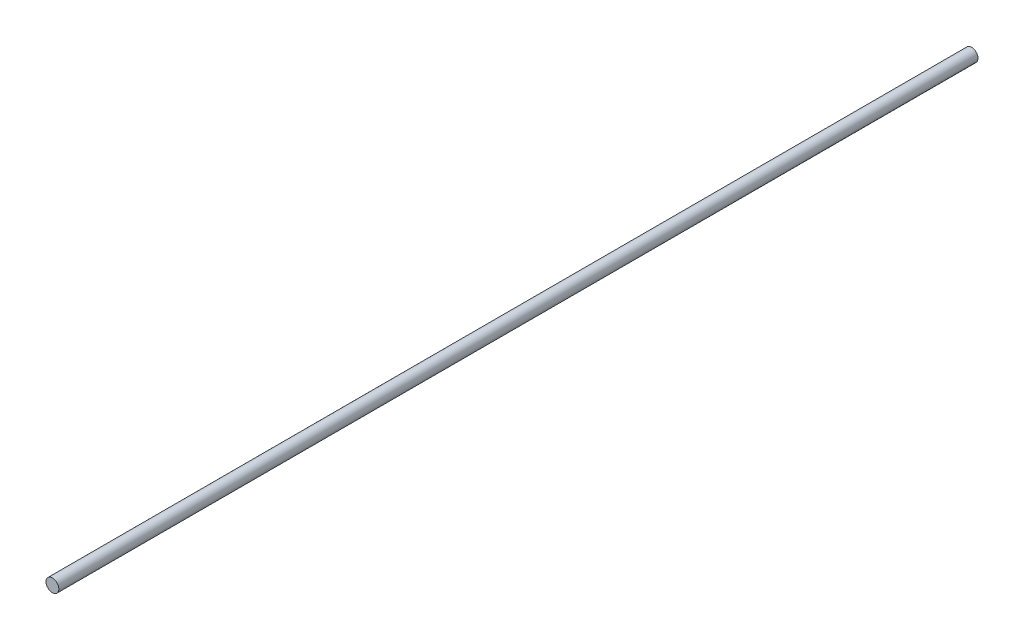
ISO-10303-21;
HEADER;
FILE_DESCRIPTION(('STEP AP214'),'2;1');
FILE_NAME('part.step','',(''),(''),'','','');
FILE_SCHEMA(('AUTOMOTIVE_DESIGN { 1 0 10303 214 1 1 1 1 }'));
ENDSEC;
DATA;
#1=APPLICATION_CONTEXT('core data for automotive mechanical design processes');
#2=APPLICATION_PROTOCOL_DEFINITION('international standard','automotive_design',2000,#1);
#3=PRODUCT_CONTEXT('',#1,'mechanical');
#4=PRODUCT('Part','Part','',(#3));
#5=PRODUCT_RELATED_PRODUCT_CATEGORY('part','',(#4));
#6=PRODUCT_DEFINITION_FORMATION('','',#4);
#7=PRODUCT_DEFINITION_CONTEXT('part definition',#1,'design');
#8=PRODUCT_DEFINITION('design','',#6,#7);
#9=PRODUCT_DEFINITION_SHAPE('','',#8);
#10=(LENGTH_UNIT() NAMED_UNIT(*) SI_UNIT(.MILLI.,.METRE.));
#11=(NAMED_UNIT(*) PLANE_ANGLE_UNIT() SI_UNIT($,.RADIAN.));
#12=(NAMED_UNIT(*) SI_UNIT($,.STERADIAN.) SOLID_ANGLE_UNIT());
#13=UNCERTAINTY_MEASURE_WITH_UNIT(LENGTH_MEASURE(1.E-05),#10,'distance_accuracy_value','');
#14=(GEOMETRIC_REPRESENTATION_CONTEXT(3) GLOBAL_UNCERTAINTY_ASSIGNED_CONTEXT((#13)) GLOBAL_UNIT_ASSIGNED_CONTEXT((#10,
#11,#12)) REPRESENTATION_CONTEXT('',''));
#15=CARTESIAN_POINT('',(0.,0.,0.));
#16=DIRECTION('',(0.,0.,1.));
#17=DIRECTION('',(1.,0.,0.));
#18=AXIS2_PLACEMENT_3D('',#15,#16,#17);
#19=CARTESIAN_POINT('',(0.,0.,-4300.));
#20=DIRECTION('',(0.,0.,1.));
#21=DIRECTION('',(1.,0.,0.));
#22=AXIS2_PLACEMENT_3D('',#19,#20,#21);
#23=CYLINDRICAL_SURFACE('',#22,30.);
#24=CARTESIAN_POINT('',(0.,0.,-4300.));
#25=DIRECTION('',(0.,0.,1.));
#26=DIRECTION('',(1.,0.,0.));
#27=AXIS2_PLACEMENT_3D('',#24,#25,#26);
#28=CIRCLE('',#27,30.);
#29=CARTESIAN_POINT('',(30.,0.,-4300.));
#30=VERTEX_POINT('',#29);
#31=EDGE_CURVE('E10',#30,#30,#28,.T.);
#32=ORIENTED_EDGE('',*,*,#31,.T.);
#33=EDGE_LOOP('',(#32));
#34=FACE_BOUND('',#33,.T.);
#35=CARTESIAN_POINT('',(0.,0.,0.));
#36=DIRECTION('',(0.,0.,1.));
#37=DIRECTION('',(1.,0.,0.));
#38=AXIS2_PLACEMENT_3D('',#35,#36,#37);
#39=CIRCLE('',#38,30.);
#40=CARTESIAN_POINT('',(30.,0.,0.));
#41=VERTEX_POINT('',#40);
#42=EDGE_CURVE('E40',#41,#41,#39,.T.);
#43=ORIENTED_EDGE('',*,*,#42,.F.);
#44=EDGE_LOOP('',(#43));
#45=FACE_BOUND('',#44,.T.);
#46=ADVANCED_FACE('F37',(#34,#45),#23,.T.);
#47=CARTESIAN_POINT('',(0.,0.,-4300.));
#48=DIRECTION('',(0.,0.,1.));
#49=DIRECTION('',(1.,0.,0.));
#50=AXIS2_PLACEMENT_3D('',#47,#48,#49);
#51=PLANE('',#50);
#52=ORIENTED_EDGE('',*,*,#31,.F.);
#53=EDGE_LOOP('',(#52));
#54=FACE_BOUND('',#53,.T.);
#55=ADVANCED_FACE('F54',(#54),#51,.F.);
#56=CARTESIAN_POINT('',(0.,0.,0.));
#57=DIRECTION('',(0.,0.,1.));
#58=DIRECTION('',(1.,0.,0.));
#59=AXIS2_PLACEMENT_3D('',#56,#57,#58);
#60=PLANE('',#59);
#61=ORIENTED_EDGE('',*,*,#42,.T.);
#62=EDGE_LOOP('',(#61));
#63=FACE_BOUND('',#62,.T.);
#64=ADVANCED_FACE('F51',(#63),#60,.T.);
#65=CLOSED_SHELL('',(#46,#55,#64));
#66=MANIFOLD_SOLID_BREP('B2',#65);
#67=ADVANCED_BREP_SHAPE_REPRESENTATION('',(#18,#66),#14);
#68=SHAPE_DEFINITION_REPRESENTATION(#9,#67);
ENDSEC;
END-ISO-10303-21;
